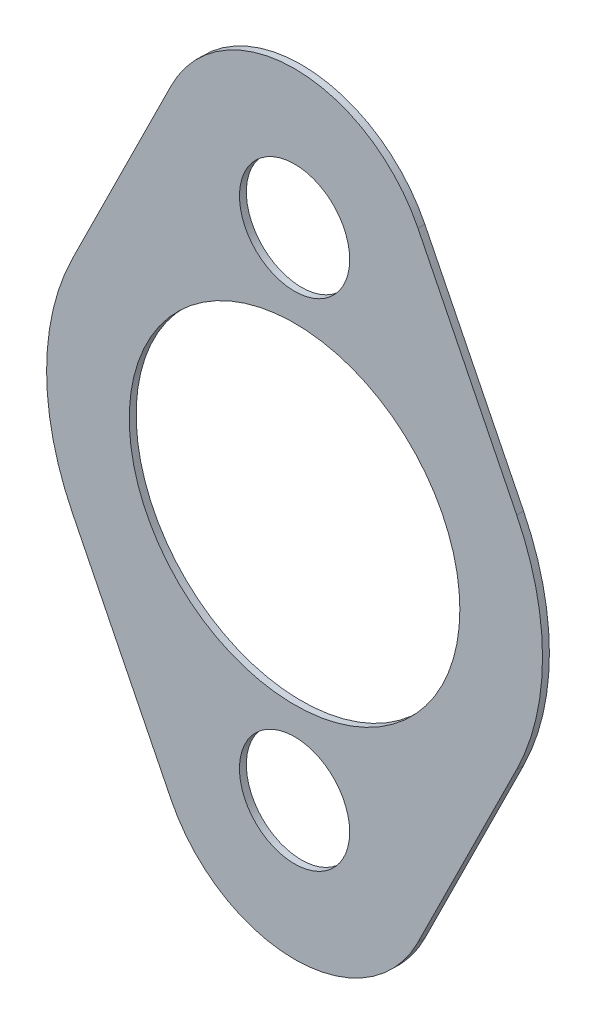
ISO-10303-21;
HEADER;
FILE_DESCRIPTION(('STEP AP214'),'2;1');
FILE_NAME('part.step','',(''),(''),'','','');
FILE_SCHEMA(('AUTOMOTIVE_DESIGN { 1 0 10303 214 1 1 1 1 }'));
ENDSEC;
DATA;
#1=APPLICATION_CONTEXT('core data for automotive mechanical design processes');
#2=APPLICATION_PROTOCOL_DEFINITION('international standard','automotive_design',2000,#1);
#3=PRODUCT_CONTEXT('',#1,'mechanical');
#4=PRODUCT('Part','Part','',(#3));
#5=PRODUCT_RELATED_PRODUCT_CATEGORY('part','',(#4));
#6=PRODUCT_DEFINITION_FORMATION('','',#4);
#7=PRODUCT_DEFINITION_CONTEXT('part definition',#1,'design');
#8=PRODUCT_DEFINITION('design','',#6,#7);
#9=PRODUCT_DEFINITION_SHAPE('','',#8);
#10=(LENGTH_UNIT() NAMED_UNIT(*) SI_UNIT(.MILLI.,.METRE.));
#11=(NAMED_UNIT(*) PLANE_ANGLE_UNIT() SI_UNIT($,.RADIAN.));
#12=(NAMED_UNIT(*) SI_UNIT($,.STERADIAN.) SOLID_ANGLE_UNIT());
#13=UNCERTAINTY_MEASURE_WITH_UNIT(LENGTH_MEASURE(1.E-05),#10,'distance_accuracy_value','');
#14=(GEOMETRIC_REPRESENTATION_CONTEXT(3) GLOBAL_UNCERTAINTY_ASSIGNED_CONTEXT((#13)) GLOBAL_UNIT_ASSIGNED_CONTEXT((#10,
#11,#12)) REPRESENTATION_CONTEXT('',''));
#15=CARTESIAN_POINT('',(0.,0.,0.));
#16=DIRECTION('',(0.,0.,1.));
#17=DIRECTION('',(1.,0.,0.));
#18=AXIS2_PLACEMENT_3D('',#15,#16,#17);
#19=CARTESIAN_POINT('',(0.,57.15,1.5875));
#20=DIRECTION('',(0.,0.,-1.));
#21=DIRECTION('',(-1.,0.,0.));
#22=AXIS2_PLACEMENT_3D('',#19,#20,#21);
#23=CYLINDRICAL_SURFACE('',#22,31.75);
#24=CARTESIAN_POINT('',(0.,57.15,0.));
#25=DIRECTION('',(0.,0.,-1.));
#26=DIRECTION('',(-1.,0.,0.));
#27=AXIS2_PLACEMENT_3D('',#24,#25,#26);
#28=CIRCLE('',#27,31.75);
#29=CARTESIAN_POINT('',(-28.4418537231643,71.2611111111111,0.));
#30=VERTEX_POINT('',#29);
#31=CARTESIAN_POINT('',(28.4418537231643,71.2611111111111,0.));
#32=VERTEX_POINT('',#31);
#33=EDGE_CURVE('E93',#30,#32,#28,.T.);
#34=ORIENTED_EDGE('',*,*,#33,.F.);
#35=DIRECTION('',(0.,0.,-1.));
#36=VECTOR('',#35,1.);
#37=CARTESIAN_POINT('',(-28.4418537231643,71.2611111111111,1.5875));
#38=LINE('',#37,#36);
#39=CARTESIAN_POINT('',(-28.4418537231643,71.2611111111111,1.5875));
#40=VERTEX_POINT('',#39);
#41=EDGE_CURVE('E11',#40,#30,#38,.T.);
#42=ORIENTED_EDGE('',*,*,#41,.F.);
#43=CARTESIAN_POINT('',(0.,57.15,1.5875));
#44=DIRECTION('',(0.,0.,-1.));
#45=DIRECTION('',(-1.,0.,0.));
#46=AXIS2_PLACEMENT_3D('',#43,#44,#45);
#47=CIRCLE('',#46,31.75);
#48=CARTESIAN_POINT('',(28.4418537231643,71.2611111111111,1.5875));
#49=VERTEX_POINT('',#48);
#50=EDGE_CURVE('E94',#40,#49,#47,.T.);
#51=ORIENTED_EDGE('',*,*,#50,.T.);
#52=DIRECTION('',(0.,0.,-1.));
#53=VECTOR('',#52,1.);
#54=CARTESIAN_POINT('',(28.4418537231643,71.2611111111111,1.5875));
#55=LINE('',#54,#53);
#56=EDGE_CURVE('E31',#49,#32,#55,.T.);
#57=ORIENTED_EDGE('',*,*,#56,.T.);
#58=EDGE_LOOP('',(#34,#42,#51,#57));
#59=FACE_BOUND('',#58,.T.);
#60=ADVANCED_FACE('F28',(#59),#23,.T.);
#61=CARTESIAN_POINT('',(-28.4418537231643,71.2611111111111,1.5875));
#62=DIRECTION('',(0.895806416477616,-0.444444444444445,0.));
#63=DIRECTION('',(0.444444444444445,0.895806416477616,0.));
#64=AXIS2_PLACEMENT_3D('',#61,#62,#63);
#65=PLANE('',#64);
#66=DIRECTION('',(-0.444444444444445,-0.895806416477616,0.));
#67=VECTOR('',#66,1.);
#68=CARTESIAN_POINT('',(-28.4418537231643,71.2611111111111,0.));
#69=LINE('',#68,#67);
#70=CARTESIAN_POINT('',(-51.1953367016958,25.4,0.));
#71=VERTEX_POINT('',#70);
#72=EDGE_CURVE('E111',#30,#71,#69,.T.);
#73=ORIENTED_EDGE('',*,*,#72,.T.);
#74=DIRECTION('',(0.,0.,-1.));
#75=VECTOR('',#74,1.);
#76=CARTESIAN_POINT('',(-51.1953367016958,25.4,1.5875));
#77=LINE('',#76,#75);
#78=CARTESIAN_POINT('',(-51.1953367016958,25.4,1.5875));
#79=VERTEX_POINT('',#78);
#80=EDGE_CURVE('E36',#79,#71,#77,.T.);
#81=ORIENTED_EDGE('',*,*,#80,.F.);
#82=DIRECTION('',(-0.444444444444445,-0.895806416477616,0.));
#83=VECTOR('',#82,1.);
#84=CARTESIAN_POINT('',(-28.4418537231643,71.2611111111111,1.5875));
#85=LINE('',#84,#83);
#86=EDGE_CURVE('E49',#40,#79,#85,.T.);
#87=ORIENTED_EDGE('',*,*,#86,.F.);
#88=ORIENTED_EDGE('',*,*,#41,.T.);
#89=EDGE_LOOP('',(#73,#81,#87,#88));
#90=FACE_BOUND('',#89,.T.);
#91=ADVANCED_FACE('F177',(#90),#65,.F.);
#92=CARTESIAN_POINT('',(0.,0.,1.5875));
#93=DIRECTION('',(0.,0.,-1.));
#94=DIRECTION('',(-1.,0.,0.));
#95=AXIS2_PLACEMENT_3D('',#92,#93,#94);
#96=CYLINDRICAL_SURFACE('',#95,57.15);
#97=CARTESIAN_POINT('',(0.,0.,0.));
#98=DIRECTION('',(0.,0.,-1.));
#99=DIRECTION('',(-1.,0.,0.));
#100=AXIS2_PLACEMENT_3D('',#97,#98,#99);
#101=CIRCLE('',#100,57.15);
#102=CARTESIAN_POINT('',(-51.1953367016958,-25.4,0.));
#103=VERTEX_POINT('',#102);
#104=EDGE_CURVE('E128',#103,#71,#101,.T.);
#105=ORIENTED_EDGE('',*,*,#104,.F.);
#106=DIRECTION('',(0.,0.,-1.));
#107=VECTOR('',#106,1.);
#108=CARTESIAN_POINT('',(-51.1953367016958,-25.4,1.5875));
#109=LINE('',#108,#107);
#110=CARTESIAN_POINT('',(-51.1953367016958,-25.4,1.5875));
#111=VERTEX_POINT('',#110);
#112=EDGE_CURVE('E149',#111,#103,#109,.T.);
#113=ORIENTED_EDGE('',*,*,#112,.F.);
#114=CARTESIAN_POINT('',(0.,0.,1.5875));
#115=DIRECTION('',(0.,0.,-1.));
#116=DIRECTION('',(-1.,0.,0.));
#117=AXIS2_PLACEMENT_3D('',#114,#115,#116);
#118=CIRCLE('',#117,57.15);
#119=EDGE_CURVE('E144',#111,#79,#118,.T.);
#120=ORIENTED_EDGE('',*,*,#119,.T.);
#121=ORIENTED_EDGE('',*,*,#80,.T.);
#122=EDGE_LOOP('',(#105,#113,#120,#121));
#123=FACE_BOUND('',#122,.T.);
#124=ADVANCED_FACE('F175',(#123),#96,.T.);
#125=CARTESIAN_POINT('',(-28.4418537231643,-71.2611111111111,1.5875));
#126=DIRECTION('',(-0.895806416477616,-0.444444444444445,0.));
#127=DIRECTION('',(0.444444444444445,-0.895806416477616,0.));
#128=AXIS2_PLACEMENT_3D('',#125,#126,#127);
#129=PLANE('',#128);
#130=DIRECTION('',(-0.444444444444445,0.895806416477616,0.));
#131=VECTOR('',#130,1.);
#132=CARTESIAN_POINT('',(-28.4418537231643,-71.2611111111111,0.));
#133=LINE('',#132,#131);
#134=CARTESIAN_POINT('',(-28.4418537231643,-71.2611111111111,0.));
#135=VERTEX_POINT('',#134);
#136=EDGE_CURVE('E125',#135,#103,#133,.T.);
#137=ORIENTED_EDGE('',*,*,#136,.F.);
#138=DIRECTION('',(0.,0.,-1.));
#139=VECTOR('',#138,1.);
#140=CARTESIAN_POINT('',(-28.4418537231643,-71.2611111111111,1.5875));
#141=LINE('',#140,#139);
#142=CARTESIAN_POINT('',(-28.4418537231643,-71.2611111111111,1.5875));
#143=VERTEX_POINT('',#142);
#144=EDGE_CURVE('E151',#143,#135,#141,.T.);
#145=ORIENTED_EDGE('',*,*,#144,.F.);
#146=DIRECTION('',(-0.444444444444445,0.895806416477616,0.));
#147=VECTOR('',#146,1.);
#148=CARTESIAN_POINT('',(-28.4418537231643,-71.2611111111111,1.5875));
#149=LINE('',#148,#147);
#150=EDGE_CURVE('E141',#143,#111,#149,.T.);
#151=ORIENTED_EDGE('',*,*,#150,.T.);
#152=ORIENTED_EDGE('',*,*,#112,.T.);
#153=EDGE_LOOP('',(#137,#145,#151,#152));
#154=FACE_BOUND('',#153,.T.);
#155=ADVANCED_FACE('F170',(#154),#129,.T.);
#156=CARTESIAN_POINT('',(0.,-57.15,1.5875));
#157=DIRECTION('',(0.,0.,-1.));
#158=DIRECTION('',(-1.,0.,0.));
#159=AXIS2_PLACEMENT_3D('',#156,#157,#158);
#160=CYLINDRICAL_SURFACE('',#159,31.75);
#161=CARTESIAN_POINT('',(0.,-57.15,0.));
#162=DIRECTION('',(0.,0.,1.));
#163=DIRECTION('',(1.,0.,0.));
#164=AXIS2_PLACEMENT_3D('',#161,#162,#163);
#165=CIRCLE('',#164,31.75);
#166=CARTESIAN_POINT('',(28.4418537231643,-71.2611111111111,0.));
#167=VERTEX_POINT('',#166);
#168=EDGE_CURVE('E123',#135,#167,#165,.T.);
#169=ORIENTED_EDGE('',*,*,#168,.T.);
#170=DIRECTION('',(0.,0.,-1.));
#171=VECTOR('',#170,1.);
#172=CARTESIAN_POINT('',(28.4418537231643,-71.2611111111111,1.5875));
#173=LINE('',#172,#171);
#174=CARTESIAN_POINT('',(28.4418537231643,-71.2611111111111,1.5875));
#175=VERTEX_POINT('',#174);
#176=EDGE_CURVE('E153',#175,#167,#173,.T.);
#177=ORIENTED_EDGE('',*,*,#176,.F.);
#178=CARTESIAN_POINT('',(0.,-57.15,1.5875));
#179=DIRECTION('',(0.,0.,1.));
#180=DIRECTION('',(1.,0.,0.));
#181=AXIS2_PLACEMENT_3D('',#178,#179,#180);
#182=CIRCLE('',#181,31.75);
#183=EDGE_CURVE('E139',#143,#175,#182,.T.);
#184=ORIENTED_EDGE('',*,*,#183,.F.);
#185=ORIENTED_EDGE('',*,*,#144,.T.);
#186=EDGE_LOOP('',(#169,#177,#184,#185));
#187=FACE_BOUND('',#186,.T.);
#188=ADVANCED_FACE('F179',(#187),#160,.T.);
#189=CARTESIAN_POINT('',(28.4418537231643,-71.2611111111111,1.5875));
#190=DIRECTION('',(-0.895806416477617,0.444444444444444,0.));
#191=DIRECTION('',(-0.444444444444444,-0.895806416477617,0.));
#192=AXIS2_PLACEMENT_3D('',#189,#190,#191);
#193=PLANE('',#192);
#194=DIRECTION('',(0.444444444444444,0.895806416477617,0.));
#195=VECTOR('',#194,1.);
#196=CARTESIAN_POINT('',(28.4418537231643,-71.2611111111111,0.));
#197=LINE('',#196,#195);
#198=CARTESIAN_POINT('',(51.1953367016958,-25.4,0.));
#199=VERTEX_POINT('',#198);
#200=EDGE_CURVE('E120',#167,#199,#197,.T.);
#201=ORIENTED_EDGE('',*,*,#200,.T.);
#202=DIRECTION('',(0.,0.,-1.));
#203=VECTOR('',#202,1.);
#204=CARTESIAN_POINT('',(51.1953367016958,-25.4,1.5875));
#205=LINE('',#204,#203);
#206=CARTESIAN_POINT('',(51.1953367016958,-25.4,1.5875));
#207=VERTEX_POINT('',#206);
#208=EDGE_CURVE('E156',#207,#199,#205,.T.);
#209=ORIENTED_EDGE('',*,*,#208,.F.);
#210=DIRECTION('',(0.444444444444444,0.895806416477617,0.));
#211=VECTOR('',#210,1.);
#212=CARTESIAN_POINT('',(28.4418537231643,-71.2611111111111,1.5875));
#213=LINE('',#212,#211);
#214=EDGE_CURVE('E137',#175,#207,#213,.T.);
#215=ORIENTED_EDGE('',*,*,#214,.F.);
#216=ORIENTED_EDGE('',*,*,#176,.T.);
#217=EDGE_LOOP('',(#201,#209,#215,#216));
#218=FACE_BOUND('',#217,.T.);
#219=ADVANCED_FACE('F164',(#218),#193,.F.);
#220=CARTESIAN_POINT('',(0.,0.,1.5875));
#221=DIRECTION('',(0.,0.,-1.));
#222=DIRECTION('',(-1.,0.,0.));
#223=AXIS2_PLACEMENT_3D('',#220,#221,#222);
#224=CYLINDRICAL_SURFACE('',#223,57.15);
#225=CARTESIAN_POINT('',(0.,0.,0.));
#226=DIRECTION('',(0.,0.,-1.));
#227=DIRECTION('',(-1.,0.,0.));
#228=AXIS2_PLACEMENT_3D('',#225,#226,#227);
#229=CIRCLE('',#228,57.15);
#230=CARTESIAN_POINT('',(51.1953367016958,25.4,0.));
#231=VERTEX_POINT('',#230);
#232=EDGE_CURVE('E105',#231,#199,#229,.T.);
#233=ORIENTED_EDGE('',*,*,#232,.F.);
#234=DIRECTION('',(0.,0.,-1.));
#235=VECTOR('',#234,1.);
#236=CARTESIAN_POINT('',(51.1953367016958,25.4,1.5875));
#237=LINE('',#236,#235);
#238=CARTESIAN_POINT('',(51.1953367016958,25.4,1.5875));
#239=VERTEX_POINT('',#238);
#240=EDGE_CURVE('E98',#239,#231,#237,.T.);
#241=ORIENTED_EDGE('',*,*,#240,.F.);
#242=CARTESIAN_POINT('',(0.,0.,1.5875));
#243=DIRECTION('',(0.,0.,-1.));
#244=DIRECTION('',(-1.,0.,0.));
#245=AXIS2_PLACEMENT_3D('',#242,#243,#244);
#246=CIRCLE('',#245,57.15);
#247=EDGE_CURVE('E134',#239,#207,#246,.T.);
#248=ORIENTED_EDGE('',*,*,#247,.T.);
#249=ORIENTED_EDGE('',*,*,#208,.T.);
#250=EDGE_LOOP('',(#233,#241,#248,#249));
#251=FACE_BOUND('',#250,.T.);
#252=ADVANCED_FACE('F159',(#251),#224,.T.);
#253=CARTESIAN_POINT('',(28.4418537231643,71.2611111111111,1.5875));
#254=DIRECTION('',(0.895806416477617,0.444444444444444,0.));
#255=DIRECTION('',(-0.444444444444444,0.895806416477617,0.));
#256=AXIS2_PLACEMENT_3D('',#253,#254,#255);
#257=PLANE('',#256);
#258=DIRECTION('',(0.444444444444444,-0.895806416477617,0.));
#259=VECTOR('',#258,1.);
#260=CARTESIAN_POINT('',(28.4418537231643,71.2611111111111,0.));
#261=LINE('',#260,#259);
#262=EDGE_CURVE('E100',#32,#231,#261,.T.);
#263=ORIENTED_EDGE('',*,*,#262,.F.);
#264=ORIENTED_EDGE('',*,*,#56,.F.);
#265=DIRECTION('',(0.444444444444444,-0.895806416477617,0.));
#266=VECTOR('',#265,1.);
#267=CARTESIAN_POINT('',(28.4418537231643,71.2611111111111,1.5875));
#268=LINE('',#267,#266);
#269=EDGE_CURVE('E132',#49,#239,#268,.T.);
#270=ORIENTED_EDGE('',*,*,#269,.T.);
#271=ORIENTED_EDGE('',*,*,#240,.T.);
#272=EDGE_LOOP('',(#263,#264,#270,#271));
#273=FACE_BOUND('',#272,.T.);
#274=ADVANCED_FACE('F101',(#273),#257,.T.);
#275=CARTESIAN_POINT('',(0.,57.15,1.5875));
#276=DIRECTION('',(0.,0.,-1.));
#277=DIRECTION('',(-1.,0.,0.));
#278=AXIS2_PLACEMENT_3D('',#275,#276,#277);
#279=PLANE('',#278);
#280=CARTESIAN_POINT('',(0.,0.,1.5875));
#281=DIRECTION('',(0.,0.,1.));
#282=DIRECTION('',(1.,0.,0.));
#283=AXIS2_PLACEMENT_3D('',#280,#281,#282);
#284=CIRCLE('',#283,38.1);
#285=CARTESIAN_POINT('',(38.1,0.,1.5875));
#286=VERTEX_POINT('',#285);
#287=EDGE_CURVE('E223',#286,#286,#284,.T.);
#288=ORIENTED_EDGE('',*,*,#287,.F.);
#289=EDGE_LOOP('',(#288));
#290=FACE_BOUND('',#289,.T.);
#291=CARTESIAN_POINT('',(0.,-57.15,1.5875));
#292=DIRECTION('',(0.,0.,1.));
#293=DIRECTION('',(1.,0.,0.));
#294=AXIS2_PLACEMENT_3D('',#291,#292,#293);
#295=CIRCLE('',#294,12.7);
#296=CARTESIAN_POINT('',(12.7,-57.15,1.5875));
#297=VERTEX_POINT('',#296);
#298=EDGE_CURVE('E225',#297,#297,#295,.T.);
#299=ORIENTED_EDGE('',*,*,#298,.F.);
#300=EDGE_LOOP('',(#299));
#301=FACE_BOUND('',#300,.T.);
#302=CARTESIAN_POINT('',(0.,57.15,1.5875));
#303=DIRECTION('',(0.,0.,1.));
#304=DIRECTION('',(1.,0.,0.));
#305=AXIS2_PLACEMENT_3D('',#302,#303,#304);
#306=CIRCLE('',#305,12.7);
#307=CARTESIAN_POINT('',(12.7,57.15,1.5875));
#308=VERTEX_POINT('',#307);
#309=EDGE_CURVE('E115',#308,#308,#306,.T.);
#310=ORIENTED_EDGE('',*,*,#309,.F.);
#311=EDGE_LOOP('',(#310));
#312=FACE_BOUND('',#311,.T.);
#313=ORIENTED_EDGE('',*,*,#50,.F.);
#314=ORIENTED_EDGE('',*,*,#86,.T.);
#315=ORIENTED_EDGE('',*,*,#119,.F.);
#316=ORIENTED_EDGE('',*,*,#150,.F.);
#317=ORIENTED_EDGE('',*,*,#183,.T.);
#318=ORIENTED_EDGE('',*,*,#214,.T.);
#319=ORIENTED_EDGE('',*,*,#247,.F.);
#320=ORIENTED_EDGE('',*,*,#269,.F.);
#321=EDGE_LOOP('',(#313,#314,#315,#316,#317,#318,#319,#320));
#322=FACE_BOUND('',#321,.T.);
#323=ADVANCED_FACE('F178',(#290,#301,#312,#322),#279,.F.);
#324=CARTESIAN_POINT('',(0.,57.15,0.));
#325=DIRECTION('',(0.,0.,-1.));
#326=DIRECTION('',(-1.,0.,0.));
#327=AXIS2_PLACEMENT_3D('',#324,#325,#326);
#328=PLANE('',#327);
#329=CARTESIAN_POINT('',(0.,0.,0.));
#330=DIRECTION('',(0.,0.,1.));
#331=DIRECTION('',(1.,0.,0.));
#332=AXIS2_PLACEMENT_3D('',#329,#330,#331);
#333=CIRCLE('',#332,38.1);
#334=CARTESIAN_POINT('',(38.1,0.,0.));
#335=VERTEX_POINT('',#334);
#336=EDGE_CURVE('E220',#335,#335,#333,.T.);
#337=ORIENTED_EDGE('',*,*,#336,.T.);
#338=EDGE_LOOP('',(#337));
#339=FACE_BOUND('',#338,.T.);
#340=CARTESIAN_POINT('',(0.,-57.15,0.));
#341=DIRECTION('',(0.,0.,1.));
#342=DIRECTION('',(1.,0.,0.));
#343=AXIS2_PLACEMENT_3D('',#340,#341,#342);
#344=CIRCLE('',#343,12.7);
#345=CARTESIAN_POINT('',(12.7,-57.15,0.));
#346=VERTEX_POINT('',#345);
#347=EDGE_CURVE('E230',#346,#346,#344,.T.);
#348=ORIENTED_EDGE('',*,*,#347,.T.);
#349=EDGE_LOOP('',(#348));
#350=FACE_BOUND('',#349,.T.);
#351=CARTESIAN_POINT('',(0.,57.15,0.));
#352=DIRECTION('',(0.,0.,1.));
#353=DIRECTION('',(1.,0.,0.));
#354=AXIS2_PLACEMENT_3D('',#351,#352,#353);
#355=CIRCLE('',#354,12.7);
#356=CARTESIAN_POINT('',(12.7,57.15,0.));
#357=VERTEX_POINT('',#356);
#358=EDGE_CURVE('E112',#357,#357,#355,.T.);
#359=ORIENTED_EDGE('',*,*,#358,.T.);
#360=EDGE_LOOP('',(#359));
#361=FACE_BOUND('',#360,.T.);
#362=ORIENTED_EDGE('',*,*,#33,.T.);
#363=ORIENTED_EDGE('',*,*,#262,.T.);
#364=ORIENTED_EDGE('',*,*,#232,.T.);
#365=ORIENTED_EDGE('',*,*,#200,.F.);
#366=ORIENTED_EDGE('',*,*,#168,.F.);
#367=ORIENTED_EDGE('',*,*,#136,.T.);
#368=ORIENTED_EDGE('',*,*,#104,.T.);
#369=ORIENTED_EDGE('',*,*,#72,.F.);
#370=EDGE_LOOP('',(#362,#363,#364,#365,#366,#367,#368,#369));
#371=FACE_BOUND('',#370,.T.);
#372=ADVANCED_FACE('F108',(#339,#350,#361,#371),#328,.T.);
#373=CARTESIAN_POINT('',(0.,57.15,0.));
#374=DIRECTION('',(0.,0.,1.));
#375=DIRECTION('',(1.,0.,0.));
#376=AXIS2_PLACEMENT_3D('',#373,#374,#375);
#377=CYLINDRICAL_SURFACE('',#376,12.7);
#378=ORIENTED_EDGE('',*,*,#358,.F.);
#379=EDGE_LOOP('',(#378));
#380=FACE_BOUND('',#379,.T.);
#381=ORIENTED_EDGE('',*,*,#309,.T.);
#382=EDGE_LOOP('',(#381));
#383=FACE_BOUND('',#382,.T.);
#384=ADVANCED_FACE('F203',(#380,#383),#377,.F.);
#385=CARTESIAN_POINT('',(0.,-57.15,0.));
#386=DIRECTION('',(0.,0.,1.));
#387=DIRECTION('',(1.,0.,0.));
#388=AXIS2_PLACEMENT_3D('',#385,#386,#387);
#389=CYLINDRICAL_SURFACE('',#388,12.7);
#390=ORIENTED_EDGE('',*,*,#347,.F.);
#391=EDGE_LOOP('',(#390));
#392=FACE_BOUND('',#391,.T.);
#393=ORIENTED_EDGE('',*,*,#298,.T.);
#394=EDGE_LOOP('',(#393));
#395=FACE_BOUND('',#394,.T.);
#396=ADVANCED_FACE('F207',(#392,#395),#389,.F.);
#397=CARTESIAN_POINT('',(0.,0.,0.));
#398=DIRECTION('',(0.,0.,1.));
#399=DIRECTION('',(1.,0.,0.));
#400=AXIS2_PLACEMENT_3D('',#397,#398,#399);
#401=CYLINDRICAL_SURFACE('',#400,38.1);
#402=ORIENTED_EDGE('',*,*,#336,.F.);
#403=EDGE_LOOP('',(#402));
#404=FACE_BOUND('',#403,.T.);
#405=ORIENTED_EDGE('',*,*,#287,.T.);
#406=EDGE_LOOP('',(#405));
#407=FACE_BOUND('',#406,.T.);
#408=ADVANCED_FACE('F211',(#404,#407),#401,.F.);
#409=CLOSED_SHELL('',(#60,#91,#124,#155,#188,#219,#252,#274,#323,#372,#384,#396,#408));
#410=MANIFOLD_SOLID_BREP('B2',#409);
#411=ADVANCED_BREP_SHAPE_REPRESENTATION('',(#18,#410),#14);
#412=SHAPE_DEFINITION_REPRESENTATION(#9,#411);
ENDSEC;
END-ISO-10303-21;
